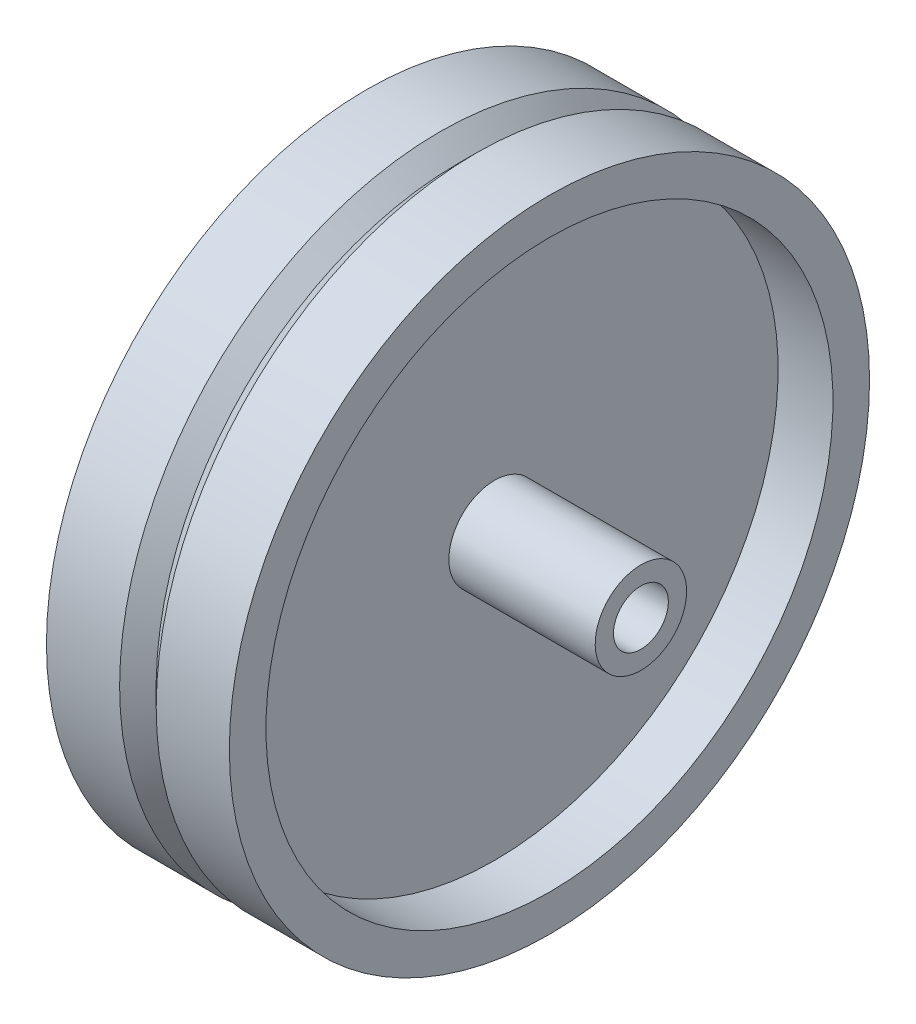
ISO-10303-21;
HEADER;
FILE_DESCRIPTION(('STEP AP214'),'2;1');
FILE_NAME('part.step','',(''),(''),'','','');
FILE_SCHEMA(('AUTOMOTIVE_DESIGN { 1 0 10303 214 1 1 1 1 }'));
ENDSEC;
DATA;
#1=APPLICATION_CONTEXT('core data for automotive mechanical design processes');
#2=APPLICATION_PROTOCOL_DEFINITION('international standard','automotive_design',2000,#1);
#3=PRODUCT_CONTEXT('',#1,'mechanical');
#4=PRODUCT('Part','Part','',(#3));
#5=PRODUCT_RELATED_PRODUCT_CATEGORY('part','',(#4));
#6=PRODUCT_DEFINITION_FORMATION('','',#4);
#7=PRODUCT_DEFINITION_CONTEXT('part definition',#1,'design');
#8=PRODUCT_DEFINITION('design','',#6,#7);
#9=PRODUCT_DEFINITION_SHAPE('','',#8);
#10=(LENGTH_UNIT() NAMED_UNIT(*) SI_UNIT(.MILLI.,.METRE.));
#11=(NAMED_UNIT(*) PLANE_ANGLE_UNIT() SI_UNIT($,.RADIAN.));
#12=(NAMED_UNIT(*) SI_UNIT($,.STERADIAN.) SOLID_ANGLE_UNIT());
#13=UNCERTAINTY_MEASURE_WITH_UNIT(LENGTH_MEASURE(1.E-05),#10,'distance_accuracy_value','');
#14=(GEOMETRIC_REPRESENTATION_CONTEXT(3) GLOBAL_UNCERTAINTY_ASSIGNED_CONTEXT((#13)) GLOBAL_UNIT_ASSIGNED_CONTEXT((#10,
#11,#12)) REPRESENTATION_CONTEXT('',''));
#15=CARTESIAN_POINT('',(0.,0.,0.));
#16=DIRECTION('',(0.,0.,1.));
#17=DIRECTION('',(1.,0.,0.));
#18=AXIS2_PLACEMENT_3D('',#15,#16,#17);
#19=CARTESIAN_POINT('',(29.,-3.,0.));
#20=DIRECTION('',(1.,0.,0.));
#21=DIRECTION('',(0.,1.,0.));
#22=AXIS2_PLACEMENT_3D('',#19,#20,#21);
#23=CYLINDRICAL_SURFACE('',#22,3.);
#24=CARTESIAN_POINT('',(29.,-3.,0.));
#25=DIRECTION('',(1.,0.,0.));
#26=DIRECTION('',(0.,1.,0.));
#27=AXIS2_PLACEMENT_3D('',#24,#25,#26);
#28=CIRCLE('',#27,3.);
#29=CARTESIAN_POINT('',(29.,0.,0.));
#30=VERTEX_POINT('',#29);
#31=EDGE_CURVE('E89',#30,#30,#28,.T.);
#32=ORIENTED_EDGE('',*,*,#31,.T.);
#33=EDGE_LOOP('',(#32));
#34=FACE_BOUND('',#33,.T.);
#35=CARTESIAN_POINT('',(-0.999999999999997,-3.,0.));
#36=DIRECTION('',(1.,0.,0.));
#37=DIRECTION('',(0.,1.,0.));
#38=AXIS2_PLACEMENT_3D('',#35,#36,#37);
#39=CIRCLE('',#38,3.);
#40=CARTESIAN_POINT('',(-0.999999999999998,0.,0.));
#41=VERTEX_POINT('',#40);
#42=EDGE_CURVE('E10',#41,#41,#39,.T.);
#43=ORIENTED_EDGE('',*,*,#42,.F.);
#44=EDGE_LOOP('',(#43));
#45=FACE_BOUND('',#44,.T.);
#46=ADVANCED_FACE('F40',(#34,#45),#23,.F.);
#47=CARTESIAN_POINT('',(-0.999999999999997,0.,0.));
#48=DIRECTION('',(-1.,0.,0.));
#49=DIRECTION('',(0.,-1.,0.));
#50=AXIS2_PLACEMENT_3D('',#47,#48,#49);
#51=PLANE('',#50);
#52=ORIENTED_EDGE('',*,*,#42,.T.);
#53=EDGE_LOOP('',(#52));
#54=FACE_BOUND('',#53,.T.);
#55=CARTESIAN_POINT('',(-0.999999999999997,-3.,0.));
#56=DIRECTION('',(1.,0.,0.));
#57=DIRECTION('',(0.,1.,0.));
#58=AXIS2_PLACEMENT_3D('',#55,#56,#57);
#59=CIRCLE('',#58,5.);
#60=CARTESIAN_POINT('',(-0.999999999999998,2.,0.));
#61=VERTEX_POINT('',#60);
#62=EDGE_CURVE('E46',#61,#61,#59,.T.);
#63=ORIENTED_EDGE('',*,*,#62,.F.);
#64=EDGE_LOOP('',(#63));
#65=FACE_BOUND('',#64,.T.);
#66=ADVANCED_FACE('F107',(#54,#65),#51,.T.);
#67=CARTESIAN_POINT('',(29.,-3.,0.));
#68=DIRECTION('',(1.,0.,0.));
#69=DIRECTION('',(0.,1.,0.));
#70=AXIS2_PLACEMENT_3D('',#67,#68,#69);
#71=CYLINDRICAL_SURFACE('',#70,5.);
#72=ORIENTED_EDGE('',*,*,#62,.T.);
#73=EDGE_LOOP('',(#72));
#74=FACE_BOUND('',#73,.T.);
#75=CARTESIAN_POINT('',(5.,-3.,0.));
#76=DIRECTION('',(1.,0.,0.));
#77=DIRECTION('',(0.,1.,0.));
#78=AXIS2_PLACEMENT_3D('',#75,#76,#77);
#79=CIRCLE('',#78,5.);
#80=CARTESIAN_POINT('',(5.,2.,0.));
#81=VERTEX_POINT('',#80);
#82=EDGE_CURVE('E50',#81,#81,#79,.T.);
#83=ORIENTED_EDGE('',*,*,#82,.F.);
#84=EDGE_LOOP('',(#83));
#85=FACE_BOUND('',#84,.T.);
#86=ADVANCED_FACE('F111',(#74,#85),#71,.T.);
#87=CARTESIAN_POINT('',(5.,28.,0.));
#88=DIRECTION('',(-1.,0.,0.));
#89=DIRECTION('',(0.,-1.,0.));
#90=AXIS2_PLACEMENT_3D('',#87,#88,#89);
#91=PLANE('',#90);
#92=ORIENTED_EDGE('',*,*,#82,.T.);
#93=EDGE_LOOP('',(#92));
#94=FACE_BOUND('',#93,.T.);
#95=CARTESIAN_POINT('',(5.,-3.,0.));
#96=DIRECTION('',(1.,0.,0.));
#97=DIRECTION('',(0.,1.,0.));
#98=AXIS2_PLACEMENT_3D('',#95,#96,#97);
#99=CIRCLE('',#98,31.);
#100=CARTESIAN_POINT('',(5.,28.,0.));
#101=VERTEX_POINT('',#100);
#102=EDGE_CURVE('E54',#101,#101,#99,.T.);
#103=ORIENTED_EDGE('',*,*,#102,.F.);
#104=EDGE_LOOP('',(#103));
#105=FACE_BOUND('',#104,.T.);
#106=ADVANCED_FACE('F115',(#94,#105),#91,.T.);
#107=CARTESIAN_POINT('',(29.,-3.,0.));
#108=DIRECTION('',(1.,0.,0.));
#109=DIRECTION('',(0.,1.,0.));
#110=AXIS2_PLACEMENT_3D('',#107,#108,#109);
#111=CYLINDRICAL_SURFACE('',#110,31.);
#112=ORIENTED_EDGE('',*,*,#102,.T.);
#113=EDGE_LOOP('',(#112));
#114=FACE_BOUND('',#113,.T.);
#115=CARTESIAN_POINT('',(-0.999999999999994,-3.,0.));
#116=DIRECTION('',(1.,0.,0.));
#117=DIRECTION('',(0.,1.,0.));
#118=AXIS2_PLACEMENT_3D('',#115,#116,#117);
#119=CIRCLE('',#118,31.);
#120=CARTESIAN_POINT('',(-0.999999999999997,28.,0.));
#121=VERTEX_POINT('',#120);
#122=EDGE_CURVE('E59',#121,#121,#119,.T.);
#123=ORIENTED_EDGE('',*,*,#122,.F.);
#124=EDGE_LOOP('',(#123));
#125=FACE_BOUND('',#124,.T.);
#126=ADVANCED_FACE('F121',(#114,#125),#111,.F.);
#127=CARTESIAN_POINT('',(-0.999999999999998,32.,0.));
#128=DIRECTION('',(-1.,0.,0.));
#129=DIRECTION('',(0.,-1.,0.));
#130=AXIS2_PLACEMENT_3D('',#127,#128,#129);
#131=PLANE('',#130);
#132=ORIENTED_EDGE('',*,*,#122,.T.);
#133=EDGE_LOOP('',(#132));
#134=FACE_BOUND('',#133,.T.);
#135=CARTESIAN_POINT('',(-0.999999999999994,-3.,0.));
#136=DIRECTION('',(1.,0.,0.));
#137=DIRECTION('',(0.,1.,0.));
#138=AXIS2_PLACEMENT_3D('',#135,#136,#137);
#139=CIRCLE('',#138,35.);
#140=CARTESIAN_POINT('',(-0.999999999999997,32.,0.));
#141=VERTEX_POINT('',#140);
#142=EDGE_CURVE('E62',#141,#141,#139,.T.);
#143=ORIENTED_EDGE('',*,*,#142,.F.);
#144=EDGE_LOOP('',(#143));
#145=FACE_BOUND('',#144,.T.);
#146=ADVANCED_FACE('F125',(#134,#145),#131,.T.);
#147=CARTESIAN_POINT('',(29.,-3.,0.));
#148=DIRECTION('',(1.,0.,0.));
#149=DIRECTION('',(0.,1.,0.));
#150=AXIS2_PLACEMENT_3D('',#147,#148,#149);
#151=CYLINDRICAL_SURFACE('',#150,35.);
#152=ORIENTED_EDGE('',*,*,#142,.T.);
#153=EDGE_LOOP('',(#152));
#154=FACE_BOUND('',#153,.T.);
#155=CARTESIAN_POINT('',(7.00000000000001,-3.,0.));
#156=DIRECTION('',(1.,0.,0.));
#157=DIRECTION('',(0.,1.,0.));
#158=AXIS2_PLACEMENT_3D('',#155,#156,#157);
#159=CIRCLE('',#158,35.);
#160=CARTESIAN_POINT('',(7.,32.,0.));
#161=VERTEX_POINT('',#160);
#162=EDGE_CURVE('E65',#161,#161,#159,.T.);
#163=ORIENTED_EDGE('',*,*,#162,.F.);
#164=EDGE_LOOP('',(#163));
#165=FACE_BOUND('',#164,.T.);
#166=ADVANCED_FACE('F129',(#154,#165),#151,.T.);
#167=CARTESIAN_POINT('',(9.00000000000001,-3.,0.));
#168=DIRECTION('',(-1.,0.,0.));
#169=DIRECTION('',(0.,-1.,0.));
#170=AXIS2_PLACEMENT_3D('',#167,#168,#169);
#171=CONICAL_SURFACE('',#170,33.,0.785398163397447);
#172=ORIENTED_EDGE('',*,*,#162,.T.);
#173=EDGE_LOOP('',(#172));
#174=FACE_BOUND('',#173,.T.);
#175=CARTESIAN_POINT('',(9.00000000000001,-3.,0.));
#176=DIRECTION('',(1.,0.,0.));
#177=DIRECTION('',(0.,1.,0.));
#178=AXIS2_PLACEMENT_3D('',#175,#176,#177);
#179=CIRCLE('',#178,33.);
#180=CARTESIAN_POINT('',(9.00000000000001,30.,0.));
#181=VERTEX_POINT('',#180);
#182=EDGE_CURVE('E68',#181,#181,#179,.T.);
#183=ORIENTED_EDGE('',*,*,#182,.F.);
#184=EDGE_LOOP('',(#183));
#185=FACE_BOUND('',#184,.T.);
#186=ADVANCED_FACE('F133',(#174,#185),#171,.T.);
#187=CARTESIAN_POINT('',(11.,-3.,0.));
#188=DIRECTION('',(1.,0.,0.));
#189=DIRECTION('',(0.,1.,0.));
#190=AXIS2_PLACEMENT_3D('',#187,#188,#189);
#191=CONICAL_SURFACE('',#190,35.,0.785398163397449);
#192=ORIENTED_EDGE('',*,*,#182,.T.);
#193=EDGE_LOOP('',(#192));
#194=FACE_BOUND('',#193,.T.);
#195=CARTESIAN_POINT('',(11.,-3.,0.));
#196=DIRECTION('',(1.,0.,0.));
#197=DIRECTION('',(0.,1.,0.));
#198=AXIS2_PLACEMENT_3D('',#195,#196,#197);
#199=CIRCLE('',#198,35.);
#200=CARTESIAN_POINT('',(11.,32.,0.));
#201=VERTEX_POINT('',#200);
#202=EDGE_CURVE('E71',#201,#201,#199,.T.);
#203=ORIENTED_EDGE('',*,*,#202,.F.);
#204=EDGE_LOOP('',(#203));
#205=FACE_BOUND('',#204,.T.);
#206=ADVANCED_FACE('F137',(#194,#205),#191,.T.);
#207=CARTESIAN_POINT('',(29.,-3.,0.));
#208=DIRECTION('',(1.,0.,0.));
#209=DIRECTION('',(0.,1.,0.));
#210=AXIS2_PLACEMENT_3D('',#207,#208,#209);
#211=CYLINDRICAL_SURFACE('',#210,35.);
#212=ORIENTED_EDGE('',*,*,#202,.T.);
#213=EDGE_LOOP('',(#212));
#214=FACE_BOUND('',#213,.T.);
#215=CARTESIAN_POINT('',(19.,-3.,0.));
#216=DIRECTION('',(1.,0.,0.));
#217=DIRECTION('',(0.,1.,0.));
#218=AXIS2_PLACEMENT_3D('',#215,#216,#217);
#219=CIRCLE('',#218,35.);
#220=CARTESIAN_POINT('',(19.,32.,0.));
#221=VERTEX_POINT('',#220);
#222=EDGE_CURVE('E74',#221,#221,#219,.T.);
#223=ORIENTED_EDGE('',*,*,#222,.F.);
#224=EDGE_LOOP('',(#223));
#225=FACE_BOUND('',#224,.T.);
#226=ADVANCED_FACE('F141',(#214,#225),#211,.T.);
#227=CARTESIAN_POINT('',(19.,28.,0.));
#228=DIRECTION('',(1.,0.,0.));
#229=DIRECTION('',(0.,1.,0.));
#230=AXIS2_PLACEMENT_3D('',#227,#228,#229);
#231=PLANE('',#230);
#232=ORIENTED_EDGE('',*,*,#222,.T.);
#233=EDGE_LOOP('',(#232));
#234=FACE_BOUND('',#233,.T.);
#235=CARTESIAN_POINT('',(19.,-3.,0.));
#236=DIRECTION('',(1.,0.,0.));
#237=DIRECTION('',(0.,1.,0.));
#238=AXIS2_PLACEMENT_3D('',#235,#236,#237);
#239=CIRCLE('',#238,31.);
#240=CARTESIAN_POINT('',(19.,28.,0.));
#241=VERTEX_POINT('',#240);
#242=EDGE_CURVE('E77',#241,#241,#239,.T.);
#243=ORIENTED_EDGE('',*,*,#242,.F.);
#244=EDGE_LOOP('',(#243));
#245=FACE_BOUND('',#244,.T.);
#246=ADVANCED_FACE('F145',(#234,#245),#231,.T.);
#247=CARTESIAN_POINT('',(29.,-3.,0.));
#248=DIRECTION('',(1.,0.,0.));
#249=DIRECTION('',(0.,1.,0.));
#250=AXIS2_PLACEMENT_3D('',#247,#248,#249);
#251=CYLINDRICAL_SURFACE('',#250,31.);
#252=ORIENTED_EDGE('',*,*,#242,.T.);
#253=EDGE_LOOP('',(#252));
#254=FACE_BOUND('',#253,.T.);
#255=CARTESIAN_POINT('',(13.,-3.,0.));
#256=DIRECTION('',(1.,0.,0.));
#257=DIRECTION('',(0.,1.,0.));
#258=AXIS2_PLACEMENT_3D('',#255,#256,#257);
#259=CIRCLE('',#258,31.);
#260=CARTESIAN_POINT('',(13.,28.,0.));
#261=VERTEX_POINT('',#260);
#262=EDGE_CURVE('E80',#261,#261,#259,.T.);
#263=ORIENTED_EDGE('',*,*,#262,.F.);
#264=EDGE_LOOP('',(#263));
#265=FACE_BOUND('',#264,.T.);
#266=ADVANCED_FACE('F149',(#254,#265),#251,.F.);
#267=CARTESIAN_POINT('',(13.,28.,0.));
#268=DIRECTION('',(1.,0.,0.));
#269=DIRECTION('',(0.,1.,0.));
#270=AXIS2_PLACEMENT_3D('',#267,#268,#269);
#271=PLANE('',#270);
#272=ORIENTED_EDGE('',*,*,#262,.T.);
#273=EDGE_LOOP('',(#272));
#274=FACE_BOUND('',#273,.T.);
#275=CARTESIAN_POINT('',(13.,-3.,0.));
#276=DIRECTION('',(1.,0.,0.));
#277=DIRECTION('',(0.,1.,0.));
#278=AXIS2_PLACEMENT_3D('',#275,#276,#277);
#279=CIRCLE('',#278,5.);
#280=CARTESIAN_POINT('',(13.,2.,0.));
#281=VERTEX_POINT('',#280);
#282=EDGE_CURVE('E83',#281,#281,#279,.T.);
#283=ORIENTED_EDGE('',*,*,#282,.F.);
#284=EDGE_LOOP('',(#283));
#285=FACE_BOUND('',#284,.T.);
#286=ADVANCED_FACE('F103',(#274,#285),#271,.T.);
#287=CARTESIAN_POINT('',(29.,-3.,0.));
#288=DIRECTION('',(1.,0.,0.));
#289=DIRECTION('',(0.,1.,0.));
#290=AXIS2_PLACEMENT_3D('',#287,#288,#289);
#291=CYLINDRICAL_SURFACE('',#290,5.);
#292=ORIENTED_EDGE('',*,*,#282,.T.);
#293=EDGE_LOOP('',(#292));
#294=FACE_BOUND('',#293,.T.);
#295=CARTESIAN_POINT('',(29.,-3.,0.));
#296=DIRECTION('',(1.,0.,0.));
#297=DIRECTION('',(0.,1.,0.));
#298=AXIS2_PLACEMENT_3D('',#295,#296,#297);
#299=CIRCLE('',#298,5.);
#300=CARTESIAN_POINT('',(29.,2.,0.));
#301=VERTEX_POINT('',#300);
#302=EDGE_CURVE('E86',#301,#301,#299,.T.);
#303=ORIENTED_EDGE('',*,*,#302,.F.);
#304=EDGE_LOOP('',(#303));
#305=FACE_BOUND('',#304,.T.);
#306=ADVANCED_FACE('F97',(#294,#305),#291,.T.);
#307=CARTESIAN_POINT('',(29.,2.,0.));
#308=DIRECTION('',(1.,0.,0.));
#309=DIRECTION('',(0.,1.,0.));
#310=AXIS2_PLACEMENT_3D('',#307,#308,#309);
#311=PLANE('',#310);
#312=ORIENTED_EDGE('',*,*,#302,.T.);
#313=EDGE_LOOP('',(#312));
#314=FACE_BOUND('',#313,.T.);
#315=ORIENTED_EDGE('',*,*,#31,.F.);
#316=EDGE_LOOP('',(#315));
#317=FACE_BOUND('',#316,.T.);
#318=ADVANCED_FACE('F95',(#314,#317),#311,.T.);
#319=CLOSED_SHELL('',(#46,#66,#86,#106,#126,#146,#166,#186,#206,#226,#246,#266,#286,#306,#318));
#320=MANIFOLD_SOLID_BREP('B2',#319);
#321=ADVANCED_BREP_SHAPE_REPRESENTATION('',(#18,#320),#14);
#322=SHAPE_DEFINITION_REPRESENTATION(#9,#321);
ENDSEC;
END-ISO-10303-21;
